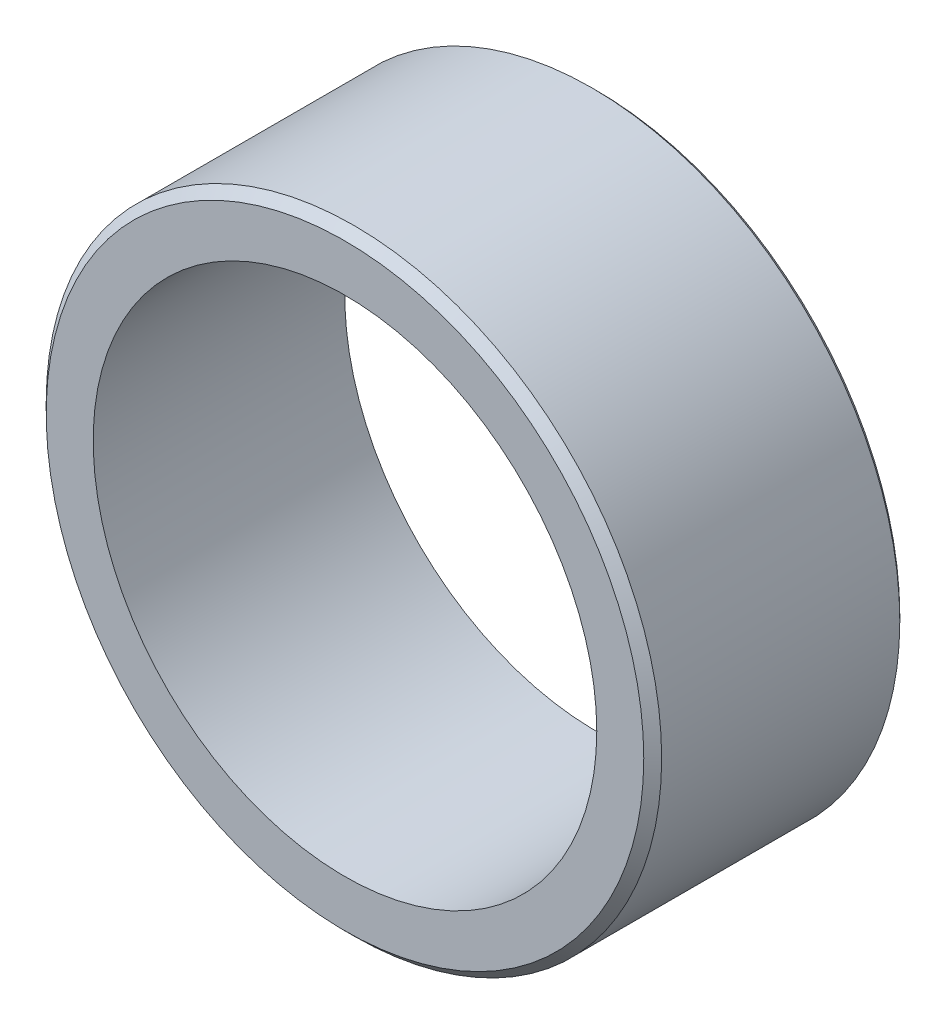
ISO-10303-21;
HEADER;
FILE_DESCRIPTION(('STEP AP214'),'2;1');
FILE_NAME('part.step','',(''),(''),'','','');
FILE_SCHEMA(('AUTOMOTIVE_DESIGN { 1 0 10303 214 1 1 1 1 }'));
ENDSEC;
DATA;
#1=APPLICATION_CONTEXT('core data for automotive mechanical design processes');
#2=APPLICATION_PROTOCOL_DEFINITION('international standard','automotive_design',2000,#1);
#3=PRODUCT_CONTEXT('',#1,'mechanical');
#4=PRODUCT('Part','Part','',(#3));
#5=PRODUCT_RELATED_PRODUCT_CATEGORY('part','',(#4));
#6=PRODUCT_DEFINITION_FORMATION('','',#4);
#7=PRODUCT_DEFINITION_CONTEXT('part definition',#1,'design');
#8=PRODUCT_DEFINITION('design','',#6,#7);
#9=PRODUCT_DEFINITION_SHAPE('','',#8);
#10=(LENGTH_UNIT() NAMED_UNIT(*) SI_UNIT(.MILLI.,.METRE.));
#11=(NAMED_UNIT(*) PLANE_ANGLE_UNIT() SI_UNIT($,.RADIAN.));
#12=(NAMED_UNIT(*) SI_UNIT($,.STERADIAN.) SOLID_ANGLE_UNIT());
#13=UNCERTAINTY_MEASURE_WITH_UNIT(LENGTH_MEASURE(1.E-05),#10,'distance_accuracy_value','');
#14=(GEOMETRIC_REPRESENTATION_CONTEXT(3) GLOBAL_UNCERTAINTY_ASSIGNED_CONTEXT((#13)) GLOBAL_UNIT_ASSIGNED_CONTEXT((#10,
#11,#12)) REPRESENTATION_CONTEXT('',''));
#15=CARTESIAN_POINT('',(0.,0.,0.));
#16=DIRECTION('',(0.,0.,1.));
#17=DIRECTION('',(1.,0.,0.));
#18=AXIS2_PLACEMENT_3D('',#15,#16,#17);
#19=CARTESIAN_POINT('',(0.,0.,7.1374));
#20=DIRECTION('',(0.,0.,1.));
#21=DIRECTION('',(1.,0.,0.));
#22=AXIS2_PLACEMENT_3D('',#19,#20,#21);
#23=PLANE('',#22);
#24=CARTESIAN_POINT('',(0.,0.,7.1374));
#25=DIRECTION('',(0.,0.,1.));
#26=DIRECTION('',(1.,0.,0.));
#27=AXIS2_PLACEMENT_3D('',#24,#25,#26);
#28=CIRCLE('',#27,16.9545);
#29=CARTESIAN_POINT('',(16.9545,0.,7.1374));
#30=VERTEX_POINT('',#29);
#31=EDGE_CURVE('E44',#30,#30,#28,.T.);
#32=ORIENTED_EDGE('',*,*,#31,.T.);
#33=EDGE_LOOP('',(#32));
#34=FACE_BOUND('',#33,.T.);
#35=CARTESIAN_POINT('',(0.,0.,7.1374));
#36=DIRECTION('',(0.,0.,1.));
#37=DIRECTION('',(1.,0.,0.));
#38=AXIS2_PLACEMENT_3D('',#35,#36,#37);
#39=CIRCLE('',#38,14.2875);
#40=CARTESIAN_POINT('',(14.2875,0.,7.1374));
#41=VERTEX_POINT('',#40);
#42=EDGE_CURVE('E49',#41,#41,#39,.T.);
#43=ORIENTED_EDGE('',*,*,#42,.F.);
#44=EDGE_LOOP('',(#43));
#45=FACE_BOUND('',#44,.T.);
#46=ADVANCED_FACE('F29',(#34,#45),#23,.T.);
#47=CARTESIAN_POINT('',(0.,0.,-7.1374));
#48=DIRECTION('',(0.,0.,1.));
#49=DIRECTION('',(1.,0.,0.));
#50=AXIS2_PLACEMENT_3D('',#47,#48,#49);
#51=PLANE('',#50);
#52=CARTESIAN_POINT('',(0.,0.,-7.1374));
#53=DIRECTION('',(0.,0.,1.));
#54=DIRECTION('',(1.,0.,0.));
#55=AXIS2_PLACEMENT_3D('',#52,#53,#54);
#56=CIRCLE('',#55,17.2085);
#57=CARTESIAN_POINT('',(17.2085,0.,-7.1374));
#58=VERTEX_POINT('',#57);
#59=EDGE_CURVE('E10',#58,#58,#56,.F.);
#60=ORIENTED_EDGE('',*,*,#59,.T.);
#61=EDGE_LOOP('',(#60));
#62=FACE_BOUND('',#61,.T.);
#63=CARTESIAN_POINT('',(0.,0.,-7.1374));
#64=DIRECTION('',(0.,0.,1.));
#65=DIRECTION('',(1.,0.,0.));
#66=AXIS2_PLACEMENT_3D('',#63,#64,#65);
#67=CIRCLE('',#66,14.2875);
#68=CARTESIAN_POINT('',(14.2875,0.,-7.1374));
#69=VERTEX_POINT('',#68);
#70=EDGE_CURVE('E52',#69,#69,#67,.T.);
#71=ORIENTED_EDGE('',*,*,#70,.T.);
#72=EDGE_LOOP('',(#71));
#73=FACE_BOUND('',#72,.T.);
#74=ADVANCED_FACE('F56',(#62,#73),#51,.F.);
#75=CARTESIAN_POINT('',(0.,0.,7.1374));
#76=DIRECTION('',(0.,0.,-1.));
#77=DIRECTION('',(-1.,0.,0.));
#78=AXIS2_PLACEMENT_3D('',#75,#76,#77);
#79=CYLINDRICAL_SURFACE('',#78,17.4625);
#80=CARTESIAN_POINT('',(0.,0.,-6.88340000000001));
#81=DIRECTION('',(0.,0.,1.));
#82=DIRECTION('',(1.,0.,0.));
#83=AXIS2_PLACEMENT_3D('',#80,#81,#82);
#84=CIRCLE('',#83,17.4625);
#85=CARTESIAN_POINT('',(17.4625,0.,-6.88340000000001));
#86=VERTEX_POINT('',#85);
#87=EDGE_CURVE('E36',#86,#86,#84,.T.);
#88=ORIENTED_EDGE('',*,*,#87,.T.);
#89=EDGE_LOOP('',(#88));
#90=FACE_BOUND('',#89,.T.);
#91=CARTESIAN_POINT('',(0.,0.,6.62939999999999));
#92=DIRECTION('',(0.,0.,1.));
#93=DIRECTION('',(1.,0.,0.));
#94=AXIS2_PLACEMENT_3D('',#91,#92,#93);
#95=CIRCLE('',#94,17.4625);
#96=CARTESIAN_POINT('',(17.4625,0.,6.62939999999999));
#97=VERTEX_POINT('',#96);
#98=EDGE_CURVE('E40',#97,#97,#95,.F.);
#99=ORIENTED_EDGE('',*,*,#98,.T.);
#100=EDGE_LOOP('',(#99));
#101=FACE_BOUND('',#100,.T.);
#102=ADVANCED_FACE('F31',(#90,#101),#79,.T.);
#103=CARTESIAN_POINT('',(0.,0.,7.1374));
#104=DIRECTION('',(0.,0.,-1.));
#105=DIRECTION('',(-1.,0.,0.));
#106=AXIS2_PLACEMENT_3D('',#103,#104,#105);
#107=CYLINDRICAL_SURFACE('',#106,14.2875);
#108=ORIENTED_EDGE('',*,*,#42,.T.);
#109=EDGE_LOOP('',(#108));
#110=FACE_BOUND('',#109,.T.);
#111=ORIENTED_EDGE('',*,*,#70,.F.);
#112=EDGE_LOOP('',(#111));
#113=FACE_BOUND('',#112,.T.);
#114=ADVANCED_FACE('F58',(#110,#113),#107,.F.);
#115=CARTESIAN_POINT('',(0.,0.,7.1374));
#116=DIRECTION('',(0.,0.,-1.));
#117=DIRECTION('',(-1.,0.,0.));
#118=AXIS2_PLACEMENT_3D('',#115,#116,#117);
#119=CONICAL_SURFACE('',#118,16.9545,0.785398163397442);
#120=ORIENTED_EDGE('',*,*,#98,.F.);
#121=EDGE_LOOP('',(#120));
#122=FACE_BOUND('',#121,.T.);
#123=ORIENTED_EDGE('',*,*,#31,.F.);
#124=EDGE_LOOP('',(#123));
#125=FACE_BOUND('',#124,.T.);
#126=ADVANCED_FACE('F60',(#122,#125),#119,.T.);
#127=CARTESIAN_POINT('',(0.,0.,-6.88340000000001));
#128=DIRECTION('',(0.,0.,1.));
#129=DIRECTION('',(1.,0.,0.));
#130=AXIS2_PLACEMENT_3D('',#127,#128,#129);
#131=CONICAL_SURFACE('',#130,17.4625,0.785398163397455);
#132=ORIENTED_EDGE('',*,*,#59,.F.);
#133=EDGE_LOOP('',(#132));
#134=FACE_BOUND('',#133,.T.);
#135=ORIENTED_EDGE('',*,*,#87,.F.);
#136=EDGE_LOOP('',(#135));
#137=FACE_BOUND('',#136,.T.);
#138=ADVANCED_FACE('F67',(#134,#137),#131,.T.);
#139=CLOSED_SHELL('',(#46,#74,#102,#114,#126,#138));
#140=MANIFOLD_SOLID_BREP('B2',#139);
#141=ADVANCED_BREP_SHAPE_REPRESENTATION('',(#18,#140),#14);
#142=SHAPE_DEFINITION_REPRESENTATION(#9,#141);
ENDSEC;
END-ISO-10303-21;
